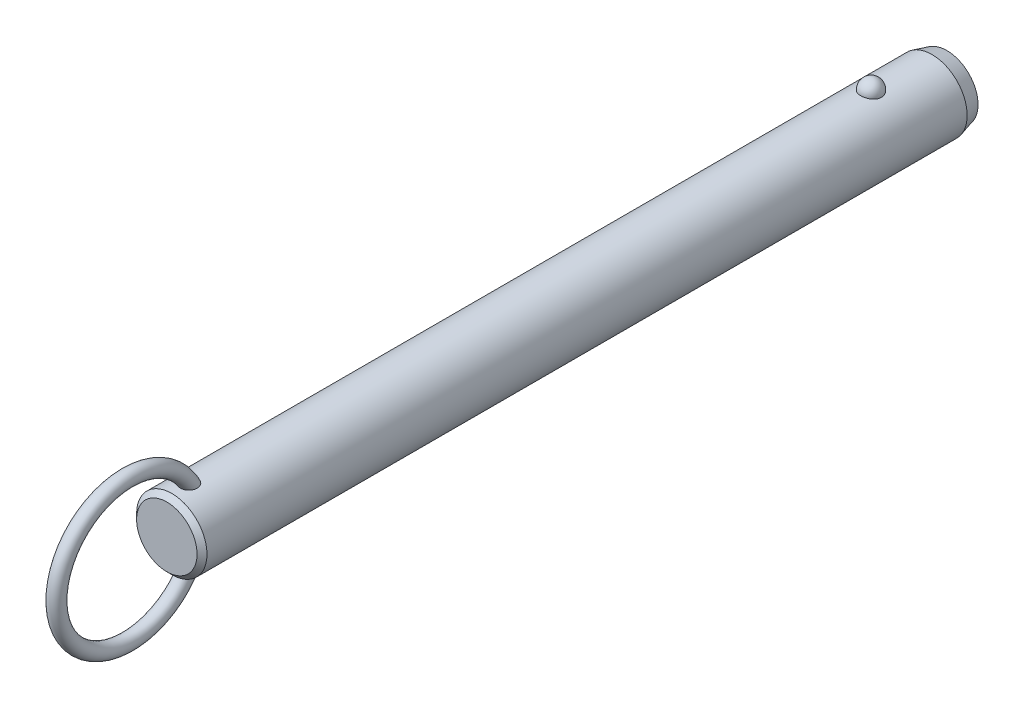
ISO-10303-21;
HEADER;
FILE_DESCRIPTION(('STEP AP214'),'2;1');
FILE_NAME('part.step','',(''),(''),'','','');
FILE_SCHEMA(('AUTOMOTIVE_DESIGN { 1 0 10303 214 1 1 1 1 }'));
ENDSEC;
DATA;
#1=APPLICATION_CONTEXT('core data for automotive mechanical design processes');
#2=APPLICATION_PROTOCOL_DEFINITION('international standard','automotive_design',2000,#1);
#3=PRODUCT_CONTEXT('',#1,'mechanical');
#4=PRODUCT('Part','Part','',(#3));
#5=PRODUCT_RELATED_PRODUCT_CATEGORY('part','',(#4));
#6=PRODUCT_DEFINITION_FORMATION('','',#4);
#7=PRODUCT_DEFINITION_CONTEXT('part definition',#1,'design');
#8=PRODUCT_DEFINITION('design','',#6,#7);
#9=PRODUCT_DEFINITION_SHAPE('','',#8);
#10=(LENGTH_UNIT() NAMED_UNIT(*) SI_UNIT(.MILLI.,.METRE.));
#11=(NAMED_UNIT(*) PLANE_ANGLE_UNIT() SI_UNIT($,.RADIAN.));
#12=(NAMED_UNIT(*) SI_UNIT($,.STERADIAN.) SOLID_ANGLE_UNIT());
#13=UNCERTAINTY_MEASURE_WITH_UNIT(LENGTH_MEASURE(1.E-05),#10,'distance_accuracy_value','');
#14=(GEOMETRIC_REPRESENTATION_CONTEXT(3) GLOBAL_UNCERTAINTY_ASSIGNED_CONTEXT((#13)) GLOBAL_UNIT_ASSIGNED_CONTEXT((#10,
#11,#12)) REPRESENTATION_CONTEXT('',''));
#15=CARTESIAN_POINT('',(0.,0.,0.));
#16=DIRECTION('',(0.,0.,1.));
#17=DIRECTION('',(1.,0.,0.));
#18=AXIS2_PLACEMENT_3D('',#15,#16,#17);
#19=CARTESIAN_POINT('',(0.,0.,132.1));
#20=DIRECTION('',(0.,0.,-1.));
#21=DIRECTION('',(-1.,0.,0.));
#22=AXIS2_PLACEMENT_3D('',#19,#20,#21);
#23=CYLINDRICAL_SURFACE('',#22,7.1);
#24=CARTESIAN_POINT('',(2.0769088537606,6.78943661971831,-2.1));
#25=CARTESIAN_POINT('',(2.07690739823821,6.78943796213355,-1.98268154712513));
#26=CARTESIAN_POINT('',(2.06738130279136,6.79237331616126,-1.86534506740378));
#27=CARTESIAN_POINT('',(2.0295040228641,6.8037853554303,-1.63400788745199));
#28=CARTESIAN_POINT('',(2.00114757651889,6.81226358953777,-1.52000812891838));
#29=CARTESIAN_POINT('',(1.92632025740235,6.83379798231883,-1.29863433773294));
#30=CARTESIAN_POINT('',(1.87985726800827,6.84685214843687,-1.19125744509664));
#31=CARTESIAN_POINT('',(1.76995205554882,6.87608091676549,-0.98604657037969));
#32=CARTESIAN_POINT('',(1.70650980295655,6.8922555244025,-0.88821260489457));
#33=CARTESIAN_POINT('',(1.5638119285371,6.92602930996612,-0.704242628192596));
#34=CARTESIAN_POINT('',(1.4844714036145,6.94363582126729,-0.618173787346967));
#35=CARTESIAN_POINT('',(1.31221746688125,6.97823658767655,-0.460740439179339));
#36=CARTESIAN_POINT('',(1.21930409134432,6.99523084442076,-0.389375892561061));
#37=CARTESIAN_POINT('',(1.02268781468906,7.02666176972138,-0.263547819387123));
#38=CARTESIAN_POINT('',(0.91902009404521,7.04110638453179,-0.209031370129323));
#39=CARTESIAN_POINT('',(0.703548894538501,7.06588726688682,-0.118163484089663));
#40=CARTESIAN_POINT('',(0.591746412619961,7.07622403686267,-0.0818098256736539));
#41=CARTESIAN_POINT('',(0.365557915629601,7.09147068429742,-0.0288711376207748));
#42=CARTESIAN_POINT('',(0.251267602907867,7.09648447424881,-0.0119070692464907));
#43=CARTESIAN_POINT('',(0.0213499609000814,7.10089837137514,0.00304925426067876));
#44=CARTESIAN_POINT('',(-0.0942772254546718,7.10029907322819,0.00104351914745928));
#45=CARTESIAN_POINT('',(-0.321651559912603,7.09360829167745,-0.0216931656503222));
#46=CARTESIAN_POINT('',(-0.433431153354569,7.08760388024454,-0.0421272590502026));
#47=CARTESIAN_POINT('',(-0.651862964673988,7.07086131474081,-0.100729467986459));
#48=CARTESIAN_POINT('',(-0.758515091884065,7.06012307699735,-0.138897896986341));
#49=CARTESIAN_POINT('',(-0.964449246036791,7.03496097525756,-0.232213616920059));
#50=CARTESIAN_POINT('',(-1.06368095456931,7.02051445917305,-0.287465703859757));
#51=CARTESIAN_POINT('',(-1.25145353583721,6.98948740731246,-0.413383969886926));
#52=CARTESIAN_POINT('',(-1.33999321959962,6.97290663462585,-0.48405186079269));
#53=CARTESIAN_POINT('',(-1.50591604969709,6.93898770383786,-0.640594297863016));
#54=CARTESIAN_POINT('',(-1.58302488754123,6.92164094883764,-0.726757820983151));
#55=CARTESIAN_POINT('',(-1.72189320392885,6.8884103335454,-0.91092752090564));
#56=CARTESIAN_POINT('',(-1.78365144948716,6.87252659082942,-1.008934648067));
#57=CARTESIAN_POINT('',(-1.89101272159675,6.84377189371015,-1.21549497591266));
#58=CARTESIAN_POINT('',(-1.93639553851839,6.83094274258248,-1.32416860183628));
#59=CARTESIAN_POINT('',(-2.00874275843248,6.81002070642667,-1.54791500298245));
#60=CARTESIAN_POINT('',(-2.03570774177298,6.80192767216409,-1.66298757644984));
#61=CARTESIAN_POINT('',(-2.07047276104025,6.7914266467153,-1.89571453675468));
#62=CARTESIAN_POINT('',(-2.07835878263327,6.78899315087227,-2.01335491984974));
#63=CARTESIAN_POINT('',(-2.07502083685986,6.79001409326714,-2.24833570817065));
#64=CARTESIAN_POINT('',(-2.06379746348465,6.7934683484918,-2.36567612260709));
#65=CARTESIAN_POINT('',(-2.02263913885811,6.80583442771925,-2.59603194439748));
#66=CARTESIAN_POINT('',(-1.99281127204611,6.81471501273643,-2.70906820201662));
#67=CARTESIAN_POINT('',(-1.91526639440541,6.83691232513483,-2.92836575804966));
#68=CARTESIAN_POINT('',(-1.8675486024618,6.85022924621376,-3.03462676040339));
#69=CARTESIAN_POINT('',(-1.75504492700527,6.87991336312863,-3.23806487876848));
#70=CARTESIAN_POINT('',(-1.69015924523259,6.89629822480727,-3.33518422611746));
#71=CARTESIAN_POINT('',(-1.54505404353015,6.93024852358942,-3.51697105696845));
#72=CARTESIAN_POINT('',(-1.46483385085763,6.94781401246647,-3.60163799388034));
#73=CARTESIAN_POINT('',(-1.29071406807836,6.98225977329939,-3.75654119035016));
#74=CARTESIAN_POINT('',(-1.19675650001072,6.99913673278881,-3.82671308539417));
#75=CARTESIAN_POINT('',(-0.997940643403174,7.03023618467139,-3.9501837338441));
#76=CARTESIAN_POINT('',(-0.89308318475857,7.04445887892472,-4.00348377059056));
#77=CARTESIAN_POINT('',(-0.676902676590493,7.06848365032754,-4.09107242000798));
#78=CARTESIAN_POINT('',(-0.565686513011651,7.0783430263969,-4.12560889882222));
#79=CARTESIAN_POINT('',(-0.338739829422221,7.09282534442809,-4.17575450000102));
#80=CARTESIAN_POINT('',(-0.223009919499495,7.09744899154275,-4.19136617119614));
#81=CARTESIAN_POINT('',(0.00707628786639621,7.10090930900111,-4.20307965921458));
#82=CARTESIAN_POINT('',(0.121410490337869,7.09986531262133,-4.19958377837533));
#83=CARTESIAN_POINT('',(0.347815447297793,7.092380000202,-4.17411564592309));
#84=CARTESIAN_POINT('',(0.459886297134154,7.08593891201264,-4.15214417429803));
#85=CARTESIAN_POINT('',(0.678084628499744,7.06838983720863,-4.09049562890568));
#86=CARTESIAN_POINT('',(0.784237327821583,7.05730369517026,-4.05090137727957));
#87=CARTESIAN_POINT('',(0.988305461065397,7.03163139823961,-3.95511447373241));
#88=CARTESIAN_POINT('',(1.08622031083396,7.01704499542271,-3.89892064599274));
#89=CARTESIAN_POINT('',(1.27284490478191,6.98562668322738,-3.77035541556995));
#90=CARTESIAN_POINT('',(1.36137372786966,6.96876135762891,-3.69772964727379));
#91=CARTESIAN_POINT('',(1.52509486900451,6.93477412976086,-3.53878279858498));
#92=CARTESIAN_POINT('',(1.60028496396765,6.91765218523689,-3.45245943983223));
#93=CARTESIAN_POINT('',(1.73681688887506,6.88465753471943,-3.26658774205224));
#94=CARTESIAN_POINT('',(1.79785966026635,6.86881574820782,-3.16681408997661));
#95=CARTESIAN_POINT('',(1.90265327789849,6.84053157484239,-2.95814408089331));
#96=CARTESIAN_POINT('',(1.94640861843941,6.82808830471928,-2.84925010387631));
#97=CARTESIAN_POINT('',(2.01274378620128,6.80881460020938,-2.63454318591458));
#98=CARTESIAN_POINT('',(2.03676193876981,6.80160856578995,-2.52920574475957));
#99=CARTESIAN_POINT('',(2.06884490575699,6.79191902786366,-2.3159172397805));
#100=CARTESIAN_POINT('',(2.07691019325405,6.78943538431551,-2.20796625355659));
#101=CARTESIAN_POINT('',(2.0769088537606,6.78943661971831,-2.1));
#102=B_SPLINE_CURVE_WITH_KNOTS('',3,(#24,#25,#26,#27,#28,#29,#30,#31,#32,#33,#34,#35,#36,#37,
#38,#39,#40,#41,#42,#43,#44,#45,#46,#47,#48,#49,#50,#51,#52,#53,#54,#55,#56,#57,#58,#59,#60,#61,
#62,#63,#64,#65,#66,#67,#68,#69,#70,#71,#72,#73,#74,#75,#76,#77,#78,#79,#80,#81,#82,#83,#84,#85,
#86,#87,#88,#89,#90,#91,#92,#93,#94,#95,#96,#97,#98,#99,#100,#101),.UNSPECIFIED.,.T.,.F.,(4,2,2,
2,2,2,2,2,2,2,2,2,2,2,2,2,2,2,2,2,2,2,2,2,2,2,2,2,2,2,2,2,2,2,2,2,2,2,4),(0.,0.351568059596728,
0.703234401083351,1.05474780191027,1.40626181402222,1.75970563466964,2.11314851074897,
2.4654696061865,2.81774759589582,3.16301449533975,3.50824481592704,3.84801136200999,
4.18778391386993,4.52968352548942,4.87162112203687,5.22076181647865,5.56993054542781,
5.92363364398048,6.27732559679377,6.62942052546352,6.98150450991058,7.33158042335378,
7.68167162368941,8.03384443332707,8.38603269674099,8.73975272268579,9.09344583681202,
9.44234545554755,9.79119807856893,10.1327344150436,10.4742563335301,10.8141898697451,
11.1541474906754,11.4997793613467,11.8454687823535,12.1979079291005,12.5502553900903,
12.8738073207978,13.1973496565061),.UNSPECIFIED.);
#103=CARTESIAN_POINT('',(2.0769088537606,6.78943661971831,-2.1));
#104=VERTEX_POINT('',#103);
#105=EDGE_CURVE('E41',#104,#104,#102,.T.);
#106=ORIENTED_EDGE('',*,*,#105,.T.);
#107=EDGE_LOOP('',(#106));
#108=FACE_BOUND('',#107,.T.);
#109=CARTESIAN_POINT('',(0.,0.,139.02));
#110=DIRECTION('',(0.,0.,1.));
#111=DIRECTION('',(1.,0.,0.));
#112=AXIS2_PLACEMENT_3D('',#109,#110,#111);
#113=CIRCLE('',#112,7.1);
#114=CARTESIAN_POINT('',(7.1,0.,139.02));
#115=VERTEX_POINT('',#114);
#116=EDGE_CURVE('E10',#115,#115,#113,.F.);
#117=ORIENTED_EDGE('',*,*,#116,.T.);
#118=EDGE_LOOP('',(#117));
#119=FACE_BOUND('',#118,.T.);
#120=CARTESIAN_POINT('',(-0.429539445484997,-7.08699541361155,133.842921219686));
#121=CARTESIAN_POINT('',(-0.508331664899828,-7.08221999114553,133.866876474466));
#122=CARTESIAN_POINT('',(-0.585039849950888,-7.07624016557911,133.897457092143));
#123=CARTESIAN_POINT('',(-0.73208265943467,-7.06254296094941,133.971024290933));
#124=CARTESIAN_POINT('',(-0.802417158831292,-7.05482554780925,134.014011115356));
#125=CARTESIAN_POINT('',(-0.934722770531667,-7.03851844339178,134.111113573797));
#126=CARTESIAN_POINT('',(-0.996700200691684,-7.02992941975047,134.165220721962));
#127=CARTESIAN_POINT('',(-1.11079942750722,-7.01280697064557,134.282967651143));
#128=CARTESIAN_POINT('',(-1.16292136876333,-7.00427354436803,134.346607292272));
#129=CARTESIAN_POINT('',(-1.25705660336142,-6.98799959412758,134.482687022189));
#130=CARTESIAN_POINT('',(-1.29888032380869,-6.98027525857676,134.555259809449));
#131=CARTESIAN_POINT('',(-1.37069920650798,-6.96652886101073,134.706168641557));
#132=CARTESIAN_POINT('',(-1.40069157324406,-6.96050720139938,134.784506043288));
#133=CARTESIAN_POINT('',(-1.45043507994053,-6.95031881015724,134.950190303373));
#134=CARTESIAN_POINT('',(-1.46937115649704,-6.94630231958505,135.037789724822));
#135=CARTESIAN_POINT('',(-1.49424917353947,-6.94099239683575,135.214871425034));
#136=CARTESIAN_POINT('',(-1.50018601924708,-6.93970003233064,135.304354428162));
#137=CARTESIAN_POINT('',(-1.49978214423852,-6.93978815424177,135.494060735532));
#138=CARTESIAN_POINT('',(-1.49187639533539,-6.94150934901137,135.594279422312));
#139=CARTESIAN_POINT('',(-1.46177925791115,-6.94790814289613,135.792479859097));
#140=CARTESIAN_POINT('',(-1.43957541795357,-6.95258831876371,135.890459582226));
#141=CARTESIAN_POINT('',(-1.37783293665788,-6.96510647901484,136.09536292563));
#142=CARTESIAN_POINT('',(-1.33634073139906,-6.97328848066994,136.201680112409));
#143=CARTESIAN_POINT('',(-1.23686994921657,-6.99161706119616,136.406177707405));
#144=CARTESIAN_POINT('',(-1.17889192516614,-7.00176357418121,136.504358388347));
#145=CARTESIAN_POINT('',(-1.05875124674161,-7.02082898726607,136.672374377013));
#146=CARTESIAN_POINT('',(-0.999247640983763,-7.02963746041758,136.744123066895));
#147=CARTESIAN_POINT('',(-0.869494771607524,-7.04686074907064,136.877195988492));
#148=CARTESIAN_POINT('',(-0.799263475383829,-7.05527619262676,136.938537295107));
#149=CARTESIAN_POINT('',(-0.665408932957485,-7.06899457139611,137.035131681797));
#150=CARTESIAN_POINT('',(-0.603817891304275,-7.07457275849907,137.073151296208));
#151=CARTESIAN_POINT('',(-0.475172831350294,-7.08437420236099,137.138758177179));
#152=CARTESIAN_POINT('',(-0.4081230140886,-7.08859848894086,137.166353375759));
#153=CARTESIAN_POINT('',(-0.26943193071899,-7.09522749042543,137.209256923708));
#154=CARTESIAN_POINT('',(-0.197757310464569,-7.09761688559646,137.224461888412));
#155=CARTESIAN_POINT('',(-0.05278498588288,-7.10017268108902,137.240716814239));
#156=CARTESIAN_POINT('',(0.020511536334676,-7.10034065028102,137.241776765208));
#157=CARTESIAN_POINT('',(0.156426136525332,-7.09855986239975,137.230461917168));
#158=CARTESIAN_POINT('',(0.219199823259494,-7.09688191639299,137.219806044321));
#159=CARTESIAN_POINT('',(0.342134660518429,-7.09201880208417,137.188537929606));
#160=CARTESIAN_POINT('',(0.402295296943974,-7.08883333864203,137.167923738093));
#161=CARTESIAN_POINT('',(0.520687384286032,-7.08113868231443,137.117212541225));
#162=CARTESIAN_POINT('',(0.578791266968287,-7.07658958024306,137.086827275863));
#163=CARTESIAN_POINT('',(0.69017323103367,-7.06659708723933,137.018367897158));
#164=CARTESIAN_POINT('',(0.743447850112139,-7.061153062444,136.980288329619));
#165=CARTESIAN_POINT('',(0.87094790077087,-7.04680292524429,136.876592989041));
#166=CARTESIAN_POINT('',(0.941828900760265,-7.03755800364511,136.806897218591));
#167=CARTESIAN_POINT('',(1.07136606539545,-7.01900793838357,136.656945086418));
#168=CARTESIAN_POINT('',(1.13000013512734,-7.00970271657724,136.576670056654));
#169=CARTESIAN_POINT('',(1.23579584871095,-6.99183327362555,136.406899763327));
#170=CARTESIAN_POINT('',(1.28274271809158,-6.98328455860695,136.317269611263));
#171=CARTESIAN_POINT('',(1.3635144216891,-6.96796352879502,136.132176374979));
#172=CARTESIAN_POINT('',(1.39733971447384,-6.96119115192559,136.036713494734));
#173=CARTESIAN_POINT('',(1.45579181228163,-6.94922464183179,135.82530928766));
#174=CARTESIAN_POINT('',(1.47790145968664,-6.94449000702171,135.708631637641));
#175=CARTESIAN_POINT('',(1.50168752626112,-6.93938731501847,135.473015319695));
#176=CARTESIAN_POINT('',(1.50336085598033,-6.93901991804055,135.35407631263));
#177=CARTESIAN_POINT('',(1.48486516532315,-6.9430010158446,135.12360799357));
#178=CARTESIAN_POINT('',(1.46573441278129,-6.9471253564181,135.011995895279));
#179=CARTESIAN_POINT('',(1.40606892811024,-6.95944667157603,134.794886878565));
#180=CARTESIAN_POINT('',(1.36556446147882,-6.96763788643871,134.6893815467));
#181=CARTESIAN_POINT('',(1.2708270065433,-6.98548038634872,134.504287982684));
#182=CARTESIAN_POINT('',(1.21949810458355,-6.99473841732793,134.423171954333));
#183=CARTESIAN_POINT('',(1.10242050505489,-7.0141406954,134.272227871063));
#184=CARTESIAN_POINT('',(1.03668119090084,-7.02428436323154,134.20239252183));
#185=CARTESIAN_POINT('',(0.900559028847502,-7.04295285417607,134.083573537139));
#186=CARTESIAN_POINT('',(0.831428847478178,-7.05153466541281,134.033157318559));
#187=CARTESIAN_POINT('',(0.685291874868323,-7.06723150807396,133.945142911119));
#188=CARTESIAN_POINT('',(0.608287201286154,-7.07434693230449,133.907541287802));
#189=CARTESIAN_POINT('',(0.451878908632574,-7.08602232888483,133.847491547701));
#190=CARTESIAN_POINT('',(0.372686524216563,-7.09067127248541,133.824508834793));
#191=CARTESIAN_POINT('',(0.211477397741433,-7.09730788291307,133.792035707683));
#192=CARTESIAN_POINT('',(0.129460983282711,-7.09929585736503,133.78254373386));
#193=CARTESIAN_POINT('',(-0.0332905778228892,-7.10037858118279,133.777351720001));
#194=CARTESIAN_POINT('',(-0.114016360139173,-7.09953334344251,133.781365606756));
#195=CARTESIAN_POINT('',(-0.27367033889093,-7.09517338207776,133.802454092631));
#196=CARTESIAN_POINT('',(-0.352598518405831,-7.09165863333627,133.819528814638));
#197=CARTESIAN_POINT('',(-0.429539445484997,-7.08699541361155,133.842921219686));
#198=B_SPLINE_CURVE_WITH_KNOTS('',3,(#120,#121,#122,#123,#124,#125,#126,#127,#128,#129,#130,
#131,#132,#133,#134,#135,#136,#137,#138,#139,#140,#141,#142,#143,#144,#145,#146,#147,#148,#149,
#150,#151,#152,#153,#154,#155,#156,#157,#158,#159,#160,#161,#162,#163,#164,#165,#166,#167,#168,
#169,#170,#171,#172,#173,#174,#175,#176,#177,#178,#179,#180,#181,#182,#183,#184,#185,#186,#187,
#188,#189,#190,#191,#192,#193,#194,#195,#196,#197),.UNSPECIFIED.,.T.,.F.,(4,2,2,2,2,2,2,2,2,2,2,
2,2,2,2,2,2,2,2,2,2,2,2,2,2,2,2,2,2,2,2,2,2,2,2,2,2,2,4),(0.,0.247183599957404,
0.494372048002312,0.741372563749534,0.988369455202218,1.23962059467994,1.490931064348,
1.75897818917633,2.02713035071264,2.3275826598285,2.62829697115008,2.97008736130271,
3.31186629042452,3.59175319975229,3.87117637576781,4.08813841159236,4.30493502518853,
4.5235225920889,4.74195577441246,4.93215328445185,5.12238804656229,5.318848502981,
5.51544871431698,5.81332317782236,6.11173048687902,6.41527266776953,6.71880423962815,
7.07358156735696,7.42841252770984,7.76631485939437,8.10373999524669,8.39142246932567,
8.67891817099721,8.93560332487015,9.19221962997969,9.43881106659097,9.68537399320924,
9.92674752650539,10.1681233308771),.UNSPECIFIED.);
#199=CARTESIAN_POINT('',(-0.429539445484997,-7.08699541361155,133.842921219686));
#200=VERTEX_POINT('',#199);
#201=EDGE_CURVE('E59',#200,#200,#198,.T.);
#202=ORIENTED_EDGE('',*,*,#201,.T.);
#203=EDGE_LOOP('',(#202));
#204=FACE_BOUND('',#203,.T.);
#205=CARTESIAN_POINT('',(-0.429539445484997,7.08699541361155,133.842921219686));
#206=CARTESIAN_POINT('',(-0.351665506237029,7.09171429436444,133.819246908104));
#207=CARTESIAN_POINT('',(-0.271733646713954,7.09525896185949,133.802036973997));
#208=CARTESIAN_POINT('',(-0.110026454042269,7.09960839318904,133.781005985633));
#209=CARTESIAN_POINT('',(-0.0282502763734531,7.10041187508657,133.777191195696));
#210=CARTESIAN_POINT('',(0.134782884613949,7.09918849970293,133.783059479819));
#211=CARTESIAN_POINT('',(0.216039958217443,7.09716214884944,133.79274013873));
#212=CARTESIAN_POINT('',(0.375730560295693,7.09050177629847,133.825347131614));
#213=CARTESIAN_POINT('',(0.454164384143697,7.08586802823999,133.848272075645));
#214=CARTESIAN_POINT('',(0.606025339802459,7.07449911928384,133.906771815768));
#215=CARTESIAN_POINT('',(0.679451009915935,7.06776334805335,133.942350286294));
#216=CARTESIAN_POINT('',(0.81923414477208,7.05292866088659,134.025175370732));
#217=CARTESIAN_POINT('',(0.885591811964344,7.04482978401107,134.072421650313));
#218=CARTESIAN_POINT('',(1.00993211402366,7.02808709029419,134.177590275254));
#219=CARTESIAN_POINT('',(1.06785399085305,7.01943990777,134.235583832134));
#220=CARTESIAN_POINT('',(1.17342527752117,7.00256662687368,134.360301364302));
#221=CARTESIAN_POINT('',(1.22107408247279,6.99434055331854,134.427025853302));
#222=CARTESIAN_POINT('',(1.30652927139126,6.97889183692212,134.569362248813));
#223=CARTESIAN_POINT('',(1.34399711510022,6.97170674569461,134.645180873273));
#224=CARTESIAN_POINT('',(1.40682616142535,6.95930080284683,134.801810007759));
#225=CARTESIAN_POINT('',(1.43218374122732,6.95408053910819,134.88262200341));
#226=CARTESIAN_POINT('',(1.47246409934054,6.94566853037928,135.053531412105));
#227=CARTESIAN_POINT('',(1.48642590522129,6.9426653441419,135.14386307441));
#228=CARTESIAN_POINT('',(1.5011410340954,6.93949744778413,135.325619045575));
#229=CARTESIAN_POINT('',(1.50188917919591,6.93933385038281,135.417043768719));
#230=CARTESIAN_POINT('',(1.49030464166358,6.94183245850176,135.61084381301));
#231=CARTESIAN_POINT('',(1.47627413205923,6.94486147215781,135.713112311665));
#232=CARTESIAN_POINT('',(1.43356351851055,6.95380194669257,135.914471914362));
#233=CARTESIAN_POINT('',(1.4048676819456,6.95971650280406,136.013559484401));
#234=CARTESIAN_POINT('',(1.32908750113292,6.97461208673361,136.218908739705));
#235=CARTESIAN_POINT('',(1.28011435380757,6.98388945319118,136.324456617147));
#236=CARTESIAN_POINT('',(1.16520357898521,7.00397743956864,136.525760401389));
#237=CARTESIAN_POINT('',(1.09927694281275,7.01478706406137,136.621522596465));
#238=CARTESIAN_POINT('',(0.969361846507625,7.03373936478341,136.776756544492));
#239=CARTESIAN_POINT('',(0.909042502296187,7.04187023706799,136.839303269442));
#240=CARTESIAN_POINT('',(0.779178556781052,7.05741732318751,136.954053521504));
#241=CARTESIAN_POINT('',(0.709649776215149,7.06483472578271,137.006274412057));
#242=CARTESIAN_POINT('',(0.576854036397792,7.0767751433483,137.088113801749));
#243=CARTESIAN_POINT('',(0.515118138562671,7.08158033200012,137.120164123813));
#244=CARTESIAN_POINT('',(0.387127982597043,7.08972701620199,137.173765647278));
#245=CARTESIAN_POINT('',(0.320877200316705,7.09306962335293,137.195324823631));
#246=CARTESIAN_POINT('',(0.185041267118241,7.09791507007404,137.226400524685));
#247=CARTESIAN_POINT('',(0.115437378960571,7.09940591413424,137.235838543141));
#248=CARTESIAN_POINT('',(-0.024315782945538,7.10030171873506,137.241522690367));
#249=CARTESIAN_POINT('',(-0.0944648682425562,7.0997073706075,137.237773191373));
#250=CARTESIAN_POINT('',(-0.225713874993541,7.09668414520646,137.218508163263));
#251=CARTESIAN_POINT('',(-0.287006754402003,7.09444865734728,137.204232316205));
#252=CARTESIAN_POINT('',(-0.406555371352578,7.08860360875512,137.166368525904));
#253=CARTESIAN_POINT('',(-0.464809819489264,7.08499346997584,137.142776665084));
#254=CARTESIAN_POINT('',(-0.594955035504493,7.07541654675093,137.078923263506));
#255=CARTESIAN_POINT('',(-0.665389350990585,7.06906574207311,137.035753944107));
#256=CARTESIAN_POINT('',(-0.798242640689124,7.05530261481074,136.938587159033));
#257=CARTESIAN_POINT('',(-0.860645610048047,7.0478882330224,136.884568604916));
#258=CARTESIAN_POINT('',(-0.994249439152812,7.03045217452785,136.750996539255));
#259=CARTESIAN_POINT('',(-1.06260129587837,7.02030745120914,136.668614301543));
#260=CARTESIAN_POINT('',(-1.18502045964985,7.00068382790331,136.493843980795));
#261=CARTESIAN_POINT('',(-1.23907684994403,6.99120544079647,136.401448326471));
#262=CARTESIAN_POINT('',(-1.33335589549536,6.97384343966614,136.208008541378));
#263=CARTESIAN_POINT('',(-1.37336138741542,6.96598557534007,136.106856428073));
#264=CARTESIAN_POINT('',(-1.43770677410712,6.95299053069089,135.899504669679));
#265=CARTESIAN_POINT('',(-1.46204473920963,6.94785368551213,135.79330440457));
#266=CARTESIAN_POINT('',(-1.49537533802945,6.94076296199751,135.568231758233));
#267=CARTESIAN_POINT('',(-1.50273564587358,6.93914842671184,135.44909751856));
#268=CARTESIAN_POINT('',(-1.4954555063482,6.94072368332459,135.211470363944));
#269=CARTESIAN_POINT('',(-1.48082914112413,6.94391040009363,135.092977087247));
#270=CARTESIAN_POINT('',(-1.43076401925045,6.95438579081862,134.873432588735));
#271=CARTESIAN_POINT('',(-1.39762227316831,6.96121852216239,134.771841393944));
#272=CARTESIAN_POINT('',(-1.31211274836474,6.97783941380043,134.577351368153));
#273=CARTESIAN_POINT('',(-1.25976607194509,6.98762432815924,134.48444313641));
#274=CARTESIAN_POINT('',(-1.14583073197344,7.00713153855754,134.324160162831));
#275=CARTESIAN_POINT('',(-1.08665947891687,7.01665982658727,134.255035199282));
#276=CARTESIAN_POINT('',(-0.95660664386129,7.03556646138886,134.128878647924));
#277=CARTESIAN_POINT('',(-0.885737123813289,7.04494495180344,134.071834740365));
#278=CARTESIAN_POINT('',(-0.751558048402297,7.06035735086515,133.983100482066));
#279=CARTESIAN_POINT('',(-0.690120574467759,7.0666695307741,133.948593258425));
#280=CARTESIAN_POINT('',(-0.562815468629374,7.07794609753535,133.888750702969));
#281=CARTESIAN_POINT('',(-0.496948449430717,7.08291067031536,133.863414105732));
#282=CARTESIAN_POINT('',(-0.429539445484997,7.08699541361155,133.842921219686));
#283=B_SPLINE_CURVE_WITH_KNOTS('',3,(#205,#206,#207,#208,#209,#210,#211,#212,#213,#214,#215,
#216,#217,#218,#219,#220,#221,#222,#223,#224,#225,#226,#227,#228,#229,#230,#231,#232,#233,#234,
#235,#236,#237,#238,#239,#240,#241,#242,#243,#244,#245,#246,#247,#248,#249,#250,#251,#252,#253,
#254,#255,#256,#257,#258,#259,#260,#261,#262,#263,#264,#265,#266,#267,#268,#269,#270,#271,#272,
#273,#274,#275,#276,#277,#278,#279,#280,#281,#282),.UNSPECIFIED.,.T.,.F.,(4,2,2,2,2,2,2,2,2,2,2,
2,2,2,2,2,2,2,2,2,2,2,2,2,2,2,2,2,2,2,2,2,2,2,2,2,2,2,4),(0.,0.244335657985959,
0.488785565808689,0.733191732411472,0.977572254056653,1.22202379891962,1.46646834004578,
1.71259457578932,1.9587352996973,2.21226768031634,2.46587585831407,2.73913816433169,
3.01250754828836,3.32109936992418,3.63002293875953,3.9786351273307,4.32702187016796,
4.58793945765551,4.84841449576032,5.05676704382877,5.26496096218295,5.47449661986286,
5.68396281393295,5.87205447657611,6.06022532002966,6.30743751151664,6.55513496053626,
6.87602468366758,7.19715875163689,7.5230577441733,7.84899686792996,8.20516155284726,
8.56109821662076,8.88040084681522,9.19935367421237,9.47236282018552,9.74509220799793,
9.95662250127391,10.1681235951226),.UNSPECIFIED.);
#284=CARTESIAN_POINT('',(-0.429539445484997,7.08699541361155,133.842921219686));
#285=VERTEX_POINT('',#284);
#286=EDGE_CURVE('E67',#285,#285,#283,.T.);
#287=ORIENTED_EDGE('',*,*,#286,.T.);
#288=EDGE_LOOP('',(#287));
#289=FACE_BOUND('',#288,.T.);
#290=CARTESIAN_POINT('',(0.,0.,-14.3999999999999));
#291=DIRECTION('',(0.,0.,-1.));
#292=DIRECTION('',(-1.,0.,0.));
#293=AXIS2_PLACEMENT_3D('',#290,#291,#292);
#294=CIRCLE('',#293,7.1);
#295=CARTESIAN_POINT('',(-7.1,0.,-14.3999999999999));
#296=VERTEX_POINT('',#295);
#297=EDGE_CURVE('E56',#296,#296,#294,.F.);
#298=ORIENTED_EDGE('',*,*,#297,.T.);
#299=EDGE_LOOP('',(#298));
#300=FACE_BOUND('',#299,.T.);
#301=ADVANCED_FACE('F37',(#108,#119,#204,#289,#300),#23,.T.);
#302=CARTESIAN_POINT('',(0.,0.,-17.4));
#303=DIRECTION('',(0.,0.,-1.));
#304=DIRECTION('',(-1.,0.,0.));
#305=AXIS2_PLACEMENT_3D('',#302,#303,#304);
#306=PLANE('',#305);
#307=CARTESIAN_POINT('',(0.,0.,-17.4));
#308=DIRECTION('',(0.,0.,-1.));
#309=DIRECTION('',(-1.,0.,0.));
#310=AXIS2_PLACEMENT_3D('',#307,#308,#309);
#311=CIRCLE('',#310,6.29615242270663);
#312=CARTESIAN_POINT('',(-6.29615242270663,0.,-17.4));
#313=VERTEX_POINT('',#312);
#314=EDGE_CURVE('E66',#313,#313,#311,.T.);
#315=ORIENTED_EDGE('',*,*,#314,.T.);
#316=EDGE_LOOP('',(#315));
#317=FACE_BOUND('',#316,.T.);
#318=ADVANCED_FACE('F85',(#317),#306,.T.);
#319=CARTESIAN_POINT('',(0.,0.,-17.4));
#320=DIRECTION('',(0.,0.,1.));
#321=DIRECTION('',(1.,0.,0.));
#322=AXIS2_PLACEMENT_3D('',#319,#320,#321);
#323=CONICAL_SURFACE('',#322,6.29615242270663,0.261799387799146);
#324=ORIENTED_EDGE('',*,*,#297,.F.);
#325=EDGE_LOOP('',(#324));
#326=FACE_BOUND('',#325,.T.);
#327=ORIENTED_EDGE('',*,*,#314,.F.);
#328=EDGE_LOOP('',(#327));
#329=FACE_BOUND('',#328,.T.);
#330=ADVANCED_FACE('F83',(#326,#329),#323,.T.);
#331=CARTESIAN_POINT('',(0.,0.,140.02));
#332=DIRECTION('',(0.,0.,1.));
#333=DIRECTION('',(1.,0.,0.));
#334=AXIS2_PLACEMENT_3D('',#331,#332,#333);
#335=PLANE('',#334);
#336=CARTESIAN_POINT('',(0.,0.,140.02));
#337=DIRECTION('',(0.,0.,1.));
#338=DIRECTION('',(1.,0.,0.));
#339=AXIS2_PLACEMENT_3D('',#336,#337,#338);
#340=CIRCLE('',#339,6.10000000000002);
#341=CARTESIAN_POINT('',(6.10000000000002,0.,140.02));
#342=VERTEX_POINT('',#341);
#343=EDGE_CURVE('E50',#342,#342,#340,.T.);
#344=ORIENTED_EDGE('',*,*,#343,.T.);
#345=EDGE_LOOP('',(#344));
#346=FACE_BOUND('',#345,.T.);
#347=ADVANCED_FACE('F77',(#346),#335,.T.);
#348=CARTESIAN_POINT('',(0.,0.,147.95));
#349=DIRECTION('',(1.,0.,0.));
#350=DIRECTION('',(0.,0.,-1.));
#351=AXIS2_PLACEMENT_3D('',#348,#349,#350);
#352=TOROIDAL_SURFACE('',#351,14.35,1.5);
#353=ORIENTED_EDGE('',*,*,#286,.F.);
#354=EDGE_LOOP('',(#353));
#355=FACE_BOUND('',#354,.T.);
#356=ORIENTED_EDGE('',*,*,#201,.F.);
#357=EDGE_LOOP('',(#356));
#358=FACE_BOUND('',#357,.T.);
#359=ADVANCED_FACE('F73',(#355,#358),#352,.T.);
#360=CARTESIAN_POINT('',(0.,0.,140.02));
#361=DIRECTION('',(0.,0.,-1.));
#362=DIRECTION('',(-1.,0.,0.));
#363=AXIS2_PLACEMENT_3D('',#360,#361,#362);
#364=CONICAL_SURFACE('',#363,6.10000000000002,0.78539816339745);
#365=ORIENTED_EDGE('',*,*,#116,.F.);
#366=EDGE_LOOP('',(#365));
#367=FACE_BOUND('',#366,.T.);
#368=ORIENTED_EDGE('',*,*,#343,.F.);
#369=EDGE_LOOP('',(#368));
#370=FACE_BOUND('',#369,.T.);
#371=ADVANCED_FACE('F39',(#367,#370),#364,.T.);
#372=CARTESIAN_POINT('',(0.,7.1,-2.1));
#373=DIRECTION('',(0.,1.,0.));
#374=DIRECTION('',(0.,0.,1.));
#375=AXIS2_PLACEMENT_3D('',#372,#373,#374);
#376=SPHERICAL_SURFACE('',#375,2.10000000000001);
#377=ORIENTED_EDGE('',*,*,#105,.F.);
#378=EDGE_LOOP('',(#377));
#379=FACE_BOUND('',#378,.T.);
#380=ADVANCED_FACE('F79',(#379),#376,.T.);
#381=CLOSED_SHELL('',(#301,#318,#330,#347,#359,#371,#380));
#382=MANIFOLD_SOLID_BREP('B2',#381);
#383=ADVANCED_BREP_SHAPE_REPRESENTATION('',(#18,#382),#14);
#384=SHAPE_DEFINITION_REPRESENTATION(#9,#383);
ENDSEC;
END-ISO-10303-21;
